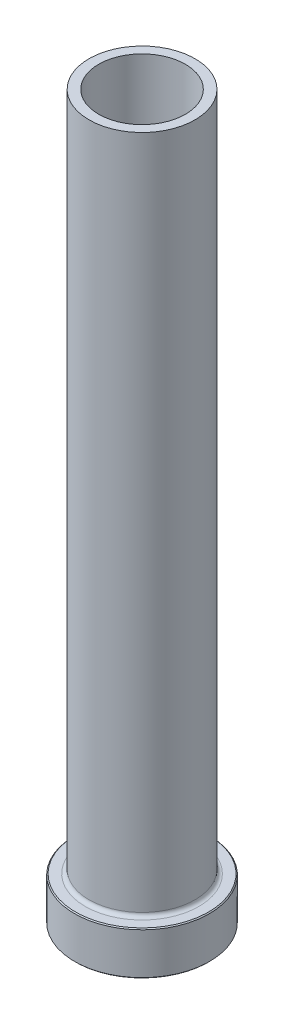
ISO-10303-21;
HEADER;
FILE_DESCRIPTION(('STEP AP214'),'2;1');
FILE_NAME('part.step','',(''),(''),'','','');
FILE_SCHEMA(('AUTOMOTIVE_DESIGN { 1 0 10303 214 1 1 1 1 }'));
ENDSEC;
DATA;
#1=APPLICATION_CONTEXT('core data for automotive mechanical design processes');
#2=APPLICATION_PROTOCOL_DEFINITION('international standard','automotive_design',2000,#1);
#3=PRODUCT_CONTEXT('',#1,'mechanical');
#4=PRODUCT('Part','Part','',(#3));
#5=PRODUCT_RELATED_PRODUCT_CATEGORY('part','',(#4));
#6=PRODUCT_DEFINITION_FORMATION('','',#4);
#7=PRODUCT_DEFINITION_CONTEXT('part definition',#1,'design');
#8=PRODUCT_DEFINITION('design','',#6,#7);
#9=PRODUCT_DEFINITION_SHAPE('','',#8);
#10=(LENGTH_UNIT() NAMED_UNIT(*) SI_UNIT(.MILLI.,.METRE.));
#11=(NAMED_UNIT(*) PLANE_ANGLE_UNIT() SI_UNIT($,.RADIAN.));
#12=(NAMED_UNIT(*) SI_UNIT($,.STERADIAN.) SOLID_ANGLE_UNIT());
#13=UNCERTAINTY_MEASURE_WITH_UNIT(LENGTH_MEASURE(1.E-05),#10,'distance_accuracy_value','');
#14=(GEOMETRIC_REPRESENTATION_CONTEXT(3) GLOBAL_UNCERTAINTY_ASSIGNED_CONTEXT((#13)) GLOBAL_UNIT_ASSIGNED_CONTEXT((#10,
#11,#12)) REPRESENTATION_CONTEXT('',''));
#15=CARTESIAN_POINT('',(0.,0.,0.));
#16=DIRECTION('',(0.,0.,1.));
#17=DIRECTION('',(1.,0.,0.));
#18=AXIS2_PLACEMENT_3D('',#15,#16,#17);
#19=CARTESIAN_POINT('',(0.,92.1876809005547,0.));
#20=DIRECTION('',(0.,1.,0.));
#21=DIRECTION('',(0.,0.,1.));
#22=AXIS2_PLACEMENT_3D('',#19,#20,#21);
#23=CYLINDRICAL_SURFACE('',#22,8.99999999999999);
#24=CARTESIAN_POINT('',(0.,150.,0.));
#25=DIRECTION('',(0.,1.,0.));
#26=DIRECTION('',(0.,0.,1.));
#27=AXIS2_PLACEMENT_3D('',#24,#25,#26);
#28=CIRCLE('',#27,9.);
#29=CARTESIAN_POINT('',(0.,150.,9.));
#30=VERTEX_POINT('',#29);
#31=EDGE_CURVE('E62',#30,#30,#28,.T.);
#32=ORIENTED_EDGE('',*,*,#31,.T.);
#33=EDGE_LOOP('',(#32));
#34=FACE_BOUND('',#33,.T.);
#35=CARTESIAN_POINT('',(0.,95.,0.));
#36=DIRECTION('',(0.,1.,0.));
#37=DIRECTION('',(0.,0.,1.));
#38=AXIS2_PLACEMENT_3D('',#35,#36,#37);
#39=CIRCLE('',#38,8.99999999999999);
#40=CARTESIAN_POINT('',(0.,95.,8.99999999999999));
#41=VERTEX_POINT('',#40);
#42=EDGE_CURVE('E71',#41,#41,#39,.T.);
#43=ORIENTED_EDGE('',*,*,#42,.F.);
#44=EDGE_LOOP('',(#43));
#45=FACE_BOUND('',#44,.T.);
#46=ADVANCED_FACE('F30',(#34,#45),#23,.F.);
#47=CARTESIAN_POINT('',(-9.,150.,0.));
#48=DIRECTION('',(0.,1.,0.));
#49=DIRECTION('',(0.,0.,1.));
#50=AXIS2_PLACEMENT_3D('',#47,#48,#49);
#51=PLANE('',#50);
#52=CARTESIAN_POINT('',(0.,150.,0.));
#53=DIRECTION('',(0.,1.,0.));
#54=DIRECTION('',(0.,0.,1.));
#55=AXIS2_PLACEMENT_3D('',#52,#53,#54);
#56=CIRCLE('',#55,11.);
#57=CARTESIAN_POINT('',(0.,150.,11.));
#58=VERTEX_POINT('',#57);
#59=EDGE_CURVE('E65',#58,#58,#56,.T.);
#60=ORIENTED_EDGE('',*,*,#59,.T.);
#61=EDGE_LOOP('',(#60));
#62=FACE_BOUND('',#61,.T.);
#63=ORIENTED_EDGE('',*,*,#31,.F.);
#64=EDGE_LOOP('',(#63));
#65=FACE_BOUND('',#64,.T.);
#66=ADVANCED_FACE('F79',(#62,#65),#51,.T.);
#67=CARTESIAN_POINT('',(0.,92.1876809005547,0.));
#68=DIRECTION('',(0.,1.,0.));
#69=DIRECTION('',(0.,0.,1.));
#70=AXIS2_PLACEMENT_3D('',#67,#68,#69);
#71=CYLINDRICAL_SURFACE('',#70,11.);
#72=CARTESIAN_POINT('',(0.,9.8,0.));
#73=DIRECTION('',(0.,1.,0.));
#74=DIRECTION('',(0.,0.,1.));
#75=AXIS2_PLACEMENT_3D('',#72,#73,#74);
#76=CIRCLE('',#75,11.);
#77=CARTESIAN_POINT('',(0.,9.8,11.));
#78=VERTEX_POINT('',#77);
#79=EDGE_CURVE('E59',#78,#78,#76,.T.);
#80=ORIENTED_EDGE('',*,*,#79,.T.);
#81=EDGE_LOOP('',(#80));
#82=FACE_BOUND('',#81,.T.);
#83=ORIENTED_EDGE('',*,*,#59,.F.);
#84=EDGE_LOOP('',(#83));
#85=FACE_BOUND('',#84,.T.);
#86=ADVANCED_FACE('F85',(#82,#85),#71,.T.);
#87=CARTESIAN_POINT('',(-11.,9.,0.));
#88=DIRECTION('',(0.,1.,0.));
#89=DIRECTION('',(0.,0.,1.));
#90=AXIS2_PLACEMENT_3D('',#87,#88,#89);
#91=PLANE('',#90);
#92=CARTESIAN_POINT('',(0.,9.,0.));
#93=DIRECTION('',(0.,1.,0.));
#94=DIRECTION('',(0.,0.,1.));
#95=AXIS2_PLACEMENT_3D('',#92,#93,#94);
#96=CIRCLE('',#95,13.8);
#97=CARTESIAN_POINT('',(0.,9.,-13.8));
#98=VERTEX_POINT('',#97);
#99=EDGE_CURVE('E53',#98,#98,#96,.T.);
#100=ORIENTED_EDGE('',*,*,#99,.T.);
#101=EDGE_LOOP('',(#100));
#102=FACE_BOUND('',#101,.T.);
#103=CARTESIAN_POINT('',(0.,9.,0.));
#104=DIRECTION('',(0.,1.,0.));
#105=DIRECTION('',(0.,0.,1.));
#106=AXIS2_PLACEMENT_3D('',#103,#104,#105);
#107=CIRCLE('',#106,11.8);
#108=CARTESIAN_POINT('',(0.,9.,11.8));
#109=VERTEX_POINT('',#108);
#110=EDGE_CURVE('E56',#109,#109,#107,.F.);
#111=ORIENTED_EDGE('',*,*,#110,.T.);
#112=EDGE_LOOP('',(#111));
#113=FACE_BOUND('',#112,.T.);
#114=ADVANCED_FACE('F111',(#102,#113),#91,.T.);
#115=CARTESIAN_POINT('',(0.,92.1876809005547,0.));
#116=DIRECTION('',(0.,1.,0.));
#117=DIRECTION('',(0.,0.,1.));
#118=AXIS2_PLACEMENT_3D('',#115,#116,#117);
#119=CYLINDRICAL_SURFACE('',#118,14.);
#120=CARTESIAN_POINT('',(0.,8.80000000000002,0.));
#121=DIRECTION('',(0.,1.,0.));
#122=DIRECTION('',(0.,0.,1.));
#123=AXIS2_PLACEMENT_3D('',#120,#121,#122);
#124=CIRCLE('',#123,14.);
#125=CARTESIAN_POINT('',(0.,8.80000000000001,-14.));
#126=VERTEX_POINT('',#125);
#127=EDGE_CURVE('E45',#126,#126,#124,.F.);
#128=ORIENTED_EDGE('',*,*,#127,.T.);
#129=EDGE_LOOP('',(#128));
#130=FACE_BOUND('',#129,.T.);
#131=CARTESIAN_POINT('',(0.,0.20000000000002,0.));
#132=DIRECTION('',(0.,-1.,0.));
#133=DIRECTION('',(0.,0.,-1.));
#134=AXIS2_PLACEMENT_3D('',#131,#132,#133);
#135=CIRCLE('',#134,14.);
#136=CARTESIAN_POINT('',(0.,0.20000000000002,-14.));
#137=VERTEX_POINT('',#136);
#138=EDGE_CURVE('E50',#137,#137,#135,.F.);
#139=ORIENTED_EDGE('',*,*,#138,.T.);
#140=EDGE_LOOP('',(#139));
#141=FACE_BOUND('',#140,.T.);
#142=ADVANCED_FACE('F108',(#130,#141),#119,.T.);
#143=CARTESIAN_POINT('',(-14.,0.,0.));
#144=DIRECTION('',(0.,-1.,0.));
#145=DIRECTION('',(0.,0.,-1.));
#146=AXIS2_PLACEMENT_3D('',#143,#144,#145);
#147=PLANE('',#146);
#148=CARTESIAN_POINT('',(0.,0.,0.));
#149=DIRECTION('',(0.,-1.,0.));
#150=DIRECTION('',(0.,0.,-1.));
#151=AXIS2_PLACEMENT_3D('',#148,#149,#150);
#152=CIRCLE('',#151,9.74999999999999);
#153=CARTESIAN_POINT('',(0.,0.,-9.74999999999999));
#154=VERTEX_POINT('',#153);
#155=EDGE_CURVE('E37',#154,#154,#152,.F.);
#156=ORIENTED_EDGE('',*,*,#155,.T.);
#157=EDGE_LOOP('',(#156));
#158=FACE_BOUND('',#157,.T.);
#159=CARTESIAN_POINT('',(0.,0.,0.));
#160=DIRECTION('',(0.,-1.,0.));
#161=DIRECTION('',(0.,0.,-1.));
#162=AXIS2_PLACEMENT_3D('',#159,#160,#161);
#163=CIRCLE('',#162,13.8);
#164=CARTESIAN_POINT('',(0.,0.,-13.8));
#165=VERTEX_POINT('',#164);
#166=EDGE_CURVE('E41',#165,#165,#163,.T.);
#167=ORIENTED_EDGE('',*,*,#166,.T.);
#168=EDGE_LOOP('',(#167));
#169=FACE_BOUND('',#168,.T.);
#170=ADVANCED_FACE('F110',(#158,#169),#147,.T.);
#171=CARTESIAN_POINT('',(0.,92.1876809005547,0.));
#172=DIRECTION('',(0.,1.,0.));
#173=DIRECTION('',(0.,0.,1.));
#174=AXIS2_PLACEMENT_3D('',#171,#172,#173);
#175=CYLINDRICAL_SURFACE('',#174,9.24999999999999);
#176=CARTESIAN_POINT('',(0.,0.500000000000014,0.));
#177=DIRECTION('',(0.,-1.,0.));
#178=DIRECTION('',(0.,0.,-1.));
#179=AXIS2_PLACEMENT_3D('',#176,#177,#178);
#180=CIRCLE('',#179,9.24999999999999);
#181=CARTESIAN_POINT('',(0.,0.500000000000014,-9.24999999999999));
#182=VERTEX_POINT('',#181);
#183=EDGE_CURVE('E10',#182,#182,#180,.T.);
#184=ORIENTED_EDGE('',*,*,#183,.T.);
#185=EDGE_LOOP('',(#184));
#186=FACE_BOUND('',#185,.T.);
#187=CARTESIAN_POINT('',(0.,83.,0.));
#188=DIRECTION('',(0.,1.,0.));
#189=DIRECTION('',(0.,0.,1.));
#190=AXIS2_PLACEMENT_3D('',#187,#188,#189);
#191=CIRCLE('',#190,9.25);
#192=CARTESIAN_POINT('',(0.,83.,9.25));
#193=VERTEX_POINT('',#192);
#194=EDGE_CURVE('E68',#193,#193,#191,.T.);
#195=ORIENTED_EDGE('',*,*,#194,.T.);
#196=EDGE_LOOP('',(#195));
#197=FACE_BOUND('',#196,.T.);
#198=ADVANCED_FACE('F118',(#186,#197),#175,.F.);
#199=CARTESIAN_POINT('',(0.,83.,0.));
#200=DIRECTION('',(0.,-1.,0.));
#201=DIRECTION('',(0.,0.,-1.));
#202=AXIS2_PLACEMENT_3D('',#199,#200,#201);
#203=CONICAL_SURFACE('',#202,9.25,0.0208303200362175);
#204=ORIENTED_EDGE('',*,*,#42,.T.);
#205=EDGE_LOOP('',(#204));
#206=FACE_BOUND('',#205,.T.);
#207=ORIENTED_EDGE('',*,*,#194,.F.);
#208=EDGE_LOOP('',(#207));
#209=FACE_BOUND('',#208,.T.);
#210=ADVANCED_FACE('F75',(#206,#209),#203,.F.);
#211=CARTESIAN_POINT('',(0.,9.8,0.));
#212=DIRECTION('',(0.,1.,0.));
#213=DIRECTION('',(0.,0.,1.));
#214=AXIS2_PLACEMENT_3D('',#211,#212,#213);
#215=TOROIDAL_SURFACE('',#214,11.8,0.8);
#216=ORIENTED_EDGE('',*,*,#110,.F.);
#217=EDGE_LOOP('',(#216));
#218=FACE_BOUND('',#217,.T.);
#219=ORIENTED_EDGE('',*,*,#79,.F.);
#220=EDGE_LOOP('',(#219));
#221=FACE_BOUND('',#220,.T.);
#222=ADVANCED_FACE('F90',(#218,#221),#215,.F.);
#223=CARTESIAN_POINT('',(0.,8.99999999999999,0.));
#224=DIRECTION('',(0.,-1.,0.));
#225=DIRECTION('',(0.,0.,-1.));
#226=AXIS2_PLACEMENT_3D('',#223,#224,#225);
#227=CONICAL_SURFACE('',#226,13.8,0.785398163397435);
#228=CARTESIAN_POINT('',(0.,8.80000000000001,-14.));
#229=CARTESIAN_POINT('',(0.,8.80208333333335,-13.9979166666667));
#230=CARTESIAN_POINT('',(0.,8.80416666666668,-13.9958333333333));
#231=CARTESIAN_POINT('',(0.,8.80833333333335,-13.9916666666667));
#232=CARTESIAN_POINT('',(0.,8.81041666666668,-13.9895833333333));
#233=CARTESIAN_POINT('',(0.,8.81458333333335,-13.9854166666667));
#234=CARTESIAN_POINT('',(0.,8.81666666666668,-13.9833333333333));
#235=CARTESIAN_POINT('',(0.,8.82083333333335,-13.9791666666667));
#236=CARTESIAN_POINT('',(0.,8.82291666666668,-13.9770833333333));
#237=CARTESIAN_POINT('',(0.,8.82708333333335,-13.9729166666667));
#238=CARTESIAN_POINT('',(0.,8.82916666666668,-13.9708333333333));
#239=CARTESIAN_POINT('',(0.,8.83333333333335,-13.9666666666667));
#240=CARTESIAN_POINT('',(0.,8.83541666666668,-13.9645833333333));
#241=CARTESIAN_POINT('',(0.,8.83958333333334,-13.9604166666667));
#242=CARTESIAN_POINT('',(0.,8.84166666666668,-13.9583333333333));
#243=CARTESIAN_POINT('',(0.,8.84583333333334,-13.9541666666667));
#244=CARTESIAN_POINT('',(0.,8.84791666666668,-13.9520833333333));
#245=CARTESIAN_POINT('',(0.,8.85208333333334,-13.9479166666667));
#246=CARTESIAN_POINT('',(0.,8.85416666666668,-13.9458333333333));
#247=CARTESIAN_POINT('',(0.,8.85833333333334,-13.9416666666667));
#248=CARTESIAN_POINT('',(0.,8.86041666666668,-13.9395833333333));
#249=CARTESIAN_POINT('',(0.,8.86458333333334,-13.9354166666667));
#250=CARTESIAN_POINT('',(0.,8.86666666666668,-13.9333333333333));
#251=CARTESIAN_POINT('',(0.,8.87083333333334,-13.9291666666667));
#252=CARTESIAN_POINT('',(0.,8.87291666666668,-13.9270833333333));
#253=CARTESIAN_POINT('',(0.,8.87708333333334,-13.9229166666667));
#254=CARTESIAN_POINT('',(0.,8.87916666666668,-13.9208333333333));
#255=CARTESIAN_POINT('',(0.,8.88333333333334,-13.9166666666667));
#256=CARTESIAN_POINT('',(0.,8.88541666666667,-13.9145833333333));
#257=CARTESIAN_POINT('',(0.,8.88958333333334,-13.9104166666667));
#258=CARTESIAN_POINT('',(0.,8.89166666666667,-13.9083333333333));
#259=CARTESIAN_POINT('',(0.,8.89583333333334,-13.9041666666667));
#260=CARTESIAN_POINT('',(0.,8.89791666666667,-13.9020833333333));
#261=CARTESIAN_POINT('',(0.,8.90208333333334,-13.8979166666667));
#262=CARTESIAN_POINT('',(0.,8.90416666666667,-13.8958333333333));
#263=CARTESIAN_POINT('',(0.,8.90833333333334,-13.8916666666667));
#264=CARTESIAN_POINT('',(0.,8.91041666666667,-13.8895833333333));
#265=CARTESIAN_POINT('',(0.,8.91458333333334,-13.8854166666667));
#266=CARTESIAN_POINT('',(0.,8.91666666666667,-13.8833333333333));
#267=CARTESIAN_POINT('',(0.,8.92083333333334,-13.8791666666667));
#268=CARTESIAN_POINT('',(0.,8.92291666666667,-13.8770833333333));
#269=CARTESIAN_POINT('',(0.,8.92708333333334,-13.8729166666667));
#270=CARTESIAN_POINT('',(0.,8.92916666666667,-13.8708333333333));
#271=CARTESIAN_POINT('',(0.,8.93333333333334,-13.8666666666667));
#272=CARTESIAN_POINT('',(0.,8.93541666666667,-13.8645833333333));
#273=CARTESIAN_POINT('',(0.,8.93958333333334,-13.8604166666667));
#274=CARTESIAN_POINT('',(0.,8.94166666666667,-13.8583333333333));
#275=CARTESIAN_POINT('',(0.,8.94583333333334,-13.8541666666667));
#276=CARTESIAN_POINT('',(0.,8.94791666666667,-13.8520833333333));
#277=CARTESIAN_POINT('',(0.,8.95208333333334,-13.8479166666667));
#278=CARTESIAN_POINT('',(0.,8.95416666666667,-13.8458333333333));
#279=CARTESIAN_POINT('',(0.,8.95833333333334,-13.8416666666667));
#280=CARTESIAN_POINT('',(0.,8.96041666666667,-13.8395833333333));
#281=CARTESIAN_POINT('',(0.,8.96458333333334,-13.8354166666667));
#282=CARTESIAN_POINT('',(0.,8.96666666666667,-13.8333333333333));
#283=CARTESIAN_POINT('',(0.,8.97083333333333,-13.8291666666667));
#284=CARTESIAN_POINT('',(0.,8.97291666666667,-13.8270833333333));
#285=CARTESIAN_POINT('',(0.,8.97708333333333,-13.8229166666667));
#286=CARTESIAN_POINT('',(0.,8.97916666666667,-13.8208333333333));
#287=CARTESIAN_POINT('',(0.,8.98333333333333,-13.8166666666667));
#288=CARTESIAN_POINT('',(0.,8.98541666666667,-13.8145833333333));
#289=CARTESIAN_POINT('',(0.,8.98958333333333,-13.8104166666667));
#290=CARTESIAN_POINT('',(0.,8.99166666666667,-13.8083333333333));
#291=CARTESIAN_POINT('',(0.,8.99583333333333,-13.8041666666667));
#292=CARTESIAN_POINT('',(0.,8.99791666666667,-13.8020833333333));
#293=CARTESIAN_POINT('',(0.,9.,-13.8));
#294=B_SPLINE_CURVE_WITH_KNOTS('',3,(#228,#229,#230,#231,#232,#233,#234,#235,#236,#237,#238,
#239,#240,#241,#242,#243,#244,#245,#246,#247,#248,#249,#250,#251,#252,#253,#254,#255,#256,#257,
#258,#259,#260,#261,#262,#263,#264,#265,#266,#267,#268,#269,#270,#271,#272,#273,#274,#275,#276,
#277,#278,#279,#280,#281,#282,#283,#284,#285,#286,#287,#288,#289,#290,#291,#292,#293),
.UNSPECIFIED.,.F.,.F.,(4,2,2,2,2,2,2,2,2,2,2,2,2,2,2,2,2,2,2,2,2,2,2,2,2,2,2,2,2,2,2,2,4),(0.,
0.0088388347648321,0.017677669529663,0.0265165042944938,0.0353553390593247,0.0441941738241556,
0.0530330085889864,0.0618718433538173,0.0707106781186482,0.079549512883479,0.0883883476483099,
0.097227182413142,0.106066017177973,0.114904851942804,0.123743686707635,0.132582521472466,
0.141421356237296,0.150260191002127,0.159099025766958,0.167937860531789,0.17677669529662,
0.185615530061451,0.194454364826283,0.203293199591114,0.212132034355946,0.220970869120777,
0.229809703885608,0.238648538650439,0.247487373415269,0.2563262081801,0.265165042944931,
0.274003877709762,0.282842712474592),.UNSPECIFIED.);
#295=EDGE_CURVE('BSEAM93',#126,#98,#294,.T.);
#296=ORIENTED_EDGE('',*,*,#127,.F.);
#297=ORIENTED_EDGE('',*,*,#99,.F.);
#298=ORIENTED_EDGE('',*,*,#295,.T.);
#299=ORIENTED_EDGE('',*,*,#295,.F.);
#300=EDGE_LOOP('',(#296,#298,#297,#299));
#301=FACE_BOUND('',#300,.T.);
#302=ADVANCED_FACE('F93',(#301),#227,.T.);
#303=CARTESIAN_POINT('',(0.,0.20000000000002,0.));
#304=DIRECTION('',(0.,1.,0.));
#305=DIRECTION('',(0.,0.,1.));
#306=AXIS2_PLACEMENT_3D('',#303,#304,#305);
#307=CONICAL_SURFACE('',#306,14.,0.785398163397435);
#308=ORIENTED_EDGE('',*,*,#166,.F.);
#309=EDGE_LOOP('',(#308));
#310=FACE_BOUND('',#309,.T.);
#311=ORIENTED_EDGE('',*,*,#138,.F.);
#312=EDGE_LOOP('',(#311));
#313=FACE_BOUND('',#312,.T.);
#314=ADVANCED_FACE('F96',(#310,#313),#307,.T.);
#315=CARTESIAN_POINT('',(0.,0.,0.));
#316=DIRECTION('',(0.,-1.,0.));
#317=DIRECTION('',(0.,0.,-1.));
#318=AXIS2_PLACEMENT_3D('',#315,#316,#317);
#319=CONICAL_SURFACE('',#318,9.74999999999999,0.785398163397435);
#320=ORIENTED_EDGE('',*,*,#183,.F.);
#321=EDGE_LOOP('',(#320));
#322=FACE_BOUND('',#321,.T.);
#323=ORIENTED_EDGE('',*,*,#155,.F.);
#324=EDGE_LOOP('',(#323));
#325=FACE_BOUND('',#324,.T.);
#326=ADVANCED_FACE('F32',(#322,#325),#319,.F.);
#327=CLOSED_SHELL('',(#46,#66,#86,#114,#142,#170,#198,#210,#222,#302,#314,#326));
#328=MANIFOLD_SOLID_BREP('B2',#327);
#329=ADVANCED_BREP_SHAPE_REPRESENTATION('',(#18,#328),#14);
#330=SHAPE_DEFINITION_REPRESENTATION(#9,#329);
ENDSEC;
END-ISO-10303-21;
